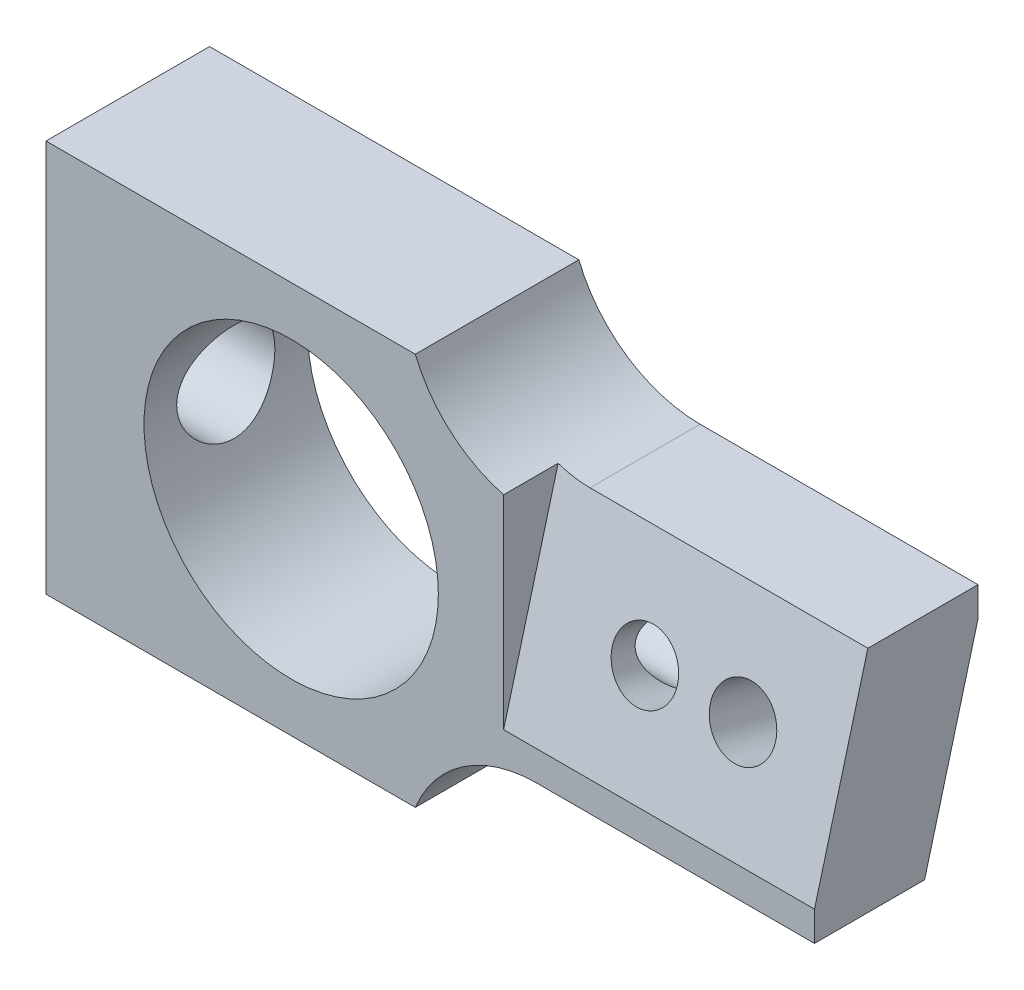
ISO-10303-21;
HEADER;
FILE_DESCRIPTION(('STEP AP214'),'2;1');
FILE_NAME('part.step','',(''),(''),'','','');
FILE_SCHEMA(('AUTOMOTIVE_DESIGN { 1 0 10303 214 1 1 1 1 }'));
ENDSEC;
DATA;
#1=APPLICATION_CONTEXT('core data for automotive mechanical design processes');
#2=APPLICATION_PROTOCOL_DEFINITION('international standard','automotive_design',2000,#1);
#3=PRODUCT_CONTEXT('',#1,'mechanical');
#4=PRODUCT('Part','Part','',(#3));
#5=PRODUCT_RELATED_PRODUCT_CATEGORY('part','',(#4));
#6=PRODUCT_DEFINITION_FORMATION('','',#4);
#7=PRODUCT_DEFINITION_CONTEXT('part definition',#1,'design');
#8=PRODUCT_DEFINITION('design','',#6,#7);
#9=PRODUCT_DEFINITION_SHAPE('','',#8);
#10=(LENGTH_UNIT() NAMED_UNIT(*) SI_UNIT(.MILLI.,.METRE.));
#11=(NAMED_UNIT(*) PLANE_ANGLE_UNIT() SI_UNIT($,.RADIAN.));
#12=(NAMED_UNIT(*) SI_UNIT($,.STERADIAN.) SOLID_ANGLE_UNIT());
#13=UNCERTAINTY_MEASURE_WITH_UNIT(LENGTH_MEASURE(1.E-05),#10,'distance_accuracy_value','');
#14=(GEOMETRIC_REPRESENTATION_CONTEXT(3) GLOBAL_UNCERTAINTY_ASSIGNED_CONTEXT((#13)) GLOBAL_UNIT_ASSIGNED_CONTEXT((#10,
#11,#12)) REPRESENTATION_CONTEXT('',''));
#15=CARTESIAN_POINT('',(0.,0.,0.));
#16=DIRECTION('',(0.,0.,1.));
#17=DIRECTION('',(1.,0.,0.));
#18=AXIS2_PLACEMENT_3D('',#15,#16,#17);
#19=CARTESIAN_POINT('',(50.8,-11.1125,7.9375));
#20=DIRECTION('',(-1.,0.,0.));
#21=DIRECTION('',(0.,0.,1.));
#22=AXIS2_PLACEMENT_3D('',#19,#20,#21);
#23=PLANE('',#22);
#24=DIRECTION('',(0.,0.965925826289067,-0.258819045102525));
#25=VECTOR('',#24,1.);
#26=CARTESIAN_POINT('',(50.8,-10.9193458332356,8.65836116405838));
#27=LINE('',#26,#25);
#28=CARTESIAN_POINT('',(50.8,-8.2290553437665,7.9375));
#29=VERTEX_POINT('',#28);
#30=CARTESIAN_POINT('',(50.8,11.1125,2.75494586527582));
#31=VERTEX_POINT('',#30);
#32=EDGE_CURVE('E156',#29,#31,#27,.T.);
#33=ORIENTED_EDGE('',*,*,#32,.F.);
#34=DIRECTION('',(0.,1.,0.));
#35=VECTOR('',#34,1.);
#36=CARTESIAN_POINT('',(50.8,-11.1125,7.9375));
#37=LINE('',#36,#35);
#38=CARTESIAN_POINT('',(50.8,-11.1125,7.9375));
#39=VERTEX_POINT('',#38);
#40=EDGE_CURVE('E195',#39,#29,#37,.T.);
#41=ORIENTED_EDGE('',*,*,#40,.F.);
#42=DIRECTION('',(0.,0.,-1.));
#43=VECTOR('',#42,1.);
#44=CARTESIAN_POINT('',(50.8,-11.1125,7.9375));
#45=LINE('',#44,#43);
#46=CARTESIAN_POINT('',(50.8,-11.1125,-2.75494586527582));
#47=VERTEX_POINT('',#46);
#48=EDGE_CURVE('E228',#39,#47,#45,.T.);
#49=ORIENTED_EDGE('',*,*,#48,.T.);
#50=DIRECTION('',(0.,-0.965925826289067,0.258819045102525));
#51=VECTOR('',#50,1.);
#52=CARTESIAN_POINT('',(50.8,-13.785611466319,-2.03868780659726));
#53=LINE('',#52,#51);
#54=CARTESIAN_POINT('',(50.8,8.2290553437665,-7.9375));
#55=VERTEX_POINT('',#54);
#56=EDGE_CURVE('E240',#55,#47,#53,.T.);
#57=ORIENTED_EDGE('',*,*,#56,.F.);
#58=DIRECTION('',(0.,1.,0.));
#59=VECTOR('',#58,1.);
#60=CARTESIAN_POINT('',(50.8,-11.1125,-7.9375));
#61=LINE('',#60,#59);
#62=CARTESIAN_POINT('',(50.8,11.1125,-7.9375));
#63=VERTEX_POINT('',#62);
#64=EDGE_CURVE('E210',#55,#63,#61,.T.);
#65=ORIENTED_EDGE('',*,*,#64,.T.);
#66=DIRECTION('',(0.,0.,-1.));
#67=VECTOR('',#66,1.);
#68=CARTESIAN_POINT('',(50.8,11.1125,7.9375));
#69=LINE('',#68,#67);
#70=EDGE_CURVE('E226',#31,#63,#69,.T.);
#71=ORIENTED_EDGE('',*,*,#70,.F.);
#72=EDGE_LOOP('',(#33,#41,#49,#57,#65,#71));
#73=FACE_BOUND('',#72,.T.);
#74=ADVANCED_FACE('F47',(#73),#23,.F.);
#75=CARTESIAN_POINT('',(23.8252,-23.8125,7.9375));
#76=DIRECTION('',(0.,0.,1.));
#77=DIRECTION('',(1.,0.,0.));
#78=AXIS2_PLACEMENT_3D('',#75,#76,#77);
#79=PLANE('',#78);
#80=CARTESIAN_POINT('',(0.,0.,7.9375));
#81=DIRECTION('',(0.,0.,1.));
#82=DIRECTION('',(1.,0.,0.));
#83=AXIS2_PLACEMENT_3D('',#80,#81,#82);
#84=CIRCLE('',#83,14.2875);
#85=CARTESIAN_POINT('',(14.2875,0.,7.9375));
#86=VERTEX_POINT('',#85);
#87=EDGE_CURVE('E179',#86,#86,#84,.T.);
#88=ORIENTED_EDGE('',*,*,#87,.F.);
#89=EDGE_LOOP('',(#88));
#90=FACE_BOUND('',#89,.T.);
#91=ORIENTED_EDGE('',*,*,#40,.T.);
#92=DIRECTION('',(-1.,0.,0.));
#93=VECTOR('',#92,1.);
#94=CARTESIAN_POINT('',(23.8252,-8.2290553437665,7.9375));
#95=LINE('',#94,#93);
#96=CARTESIAN_POINT('',(20.6248,-8.2290553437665,7.9375));
#97=VERTEX_POINT('',#96);
#98=EDGE_CURVE('E158',#29,#97,#95,.T.);
#99=ORIENTED_EDGE('',*,*,#98,.T.);
#100=DIRECTION('',(0.,-1.,0.));
#101=VECTOR('',#100,1.);
#102=CARTESIAN_POINT('',(20.6248,-23.8125,7.9375));
#103=LINE('',#102,#101);
#104=CARTESIAN_POINT('',(20.6248,11.5223641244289,7.9375));
#105=VERTEX_POINT('',#104);
#106=EDGE_CURVE('E149',#105,#97,#103,.T.);
#107=ORIENTED_EDGE('',*,*,#106,.F.);
#108=CARTESIAN_POINT('',(23.8252,23.8125,7.9375));
#109=DIRECTION('',(0.,0.,-1.));
#110=DIRECTION('',(1.,0.,0.));
#111=AXIS2_PLACEMENT_3D('',#108,#109,#110);
#112=CIRCLE('',#111,12.7);
#113=CARTESIAN_POINT('',(12.0519849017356,19.05,7.9375));
#114=VERTEX_POINT('',#113);
#115=EDGE_CURVE('E198',#105,#114,#112,.T.);
#116=ORIENTED_EDGE('',*,*,#115,.T.);
#117=DIRECTION('',(-1.,0.,0.));
#118=VECTOR('',#117,1.);
#119=CARTESIAN_POINT('',(12.0519849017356,19.05,7.9375));
#120=LINE('',#119,#118);
#121=CARTESIAN_POINT('',(-23.7998,19.05,7.9375));
#122=VERTEX_POINT('',#121);
#123=EDGE_CURVE('E200',#114,#122,#120,.T.);
#124=ORIENTED_EDGE('',*,*,#123,.T.);
#125=DIRECTION('',(0.,-1.,0.));
#126=VECTOR('',#125,1.);
#127=CARTESIAN_POINT('',(-23.7998,19.05,7.9375));
#128=LINE('',#127,#126);
#129=CARTESIAN_POINT('',(-23.7998,-19.05,7.9375));
#130=VERTEX_POINT('',#129);
#131=EDGE_CURVE('E185',#122,#130,#128,.T.);
#132=ORIENTED_EDGE('',*,*,#131,.T.);
#133=DIRECTION('',(1.,0.,0.));
#134=VECTOR('',#133,1.);
#135=CARTESIAN_POINT('',(-23.7998,-19.05,7.9375));
#136=LINE('',#135,#134);
#137=CARTESIAN_POINT('',(12.0519849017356,-19.05,7.9375));
#138=VERTEX_POINT('',#137);
#139=EDGE_CURVE('E188',#130,#138,#136,.T.);
#140=ORIENTED_EDGE('',*,*,#139,.T.);
#141=CARTESIAN_POINT('',(23.8252,-23.8125,7.9375));
#142=DIRECTION('',(0.,0.,-1.));
#143=DIRECTION('',(1.,0.,0.));
#144=AXIS2_PLACEMENT_3D('',#141,#142,#143);
#145=CIRCLE('',#144,12.7);
#146=CARTESIAN_POINT('',(23.8252,-11.1125,7.9375));
#147=VERTEX_POINT('',#146);
#148=EDGE_CURVE('E191',#138,#147,#145,.T.);
#149=ORIENTED_EDGE('',*,*,#148,.T.);
#150=DIRECTION('',(1.,0.,0.));
#151=VECTOR('',#150,1.);
#152=CARTESIAN_POINT('',(50.8,-11.1125,7.9375));
#153=LINE('',#152,#151);
#154=EDGE_CURVE('E193',#147,#39,#153,.T.);
#155=ORIENTED_EDGE('',*,*,#154,.T.);
#156=EDGE_LOOP('',(#91,#99,#107,#116,#124,#132,#140,#149,#155));
#157=FACE_BOUND('',#156,.T.);
#158=ADVANCED_FACE('F287',(#90,#157),#79,.T.);
#159=CARTESIAN_POINT('',(50.8,11.1125,7.9375));
#160=DIRECTION('',(0.,-1.,0.));
#161=DIRECTION('',(1.,0.,0.));
#162=AXIS2_PLACEMENT_3D('',#159,#160,#161);
#163=PLANE('',#162);
#164=DIRECTION('',(-1.,0.,0.));
#165=VECTOR('',#164,1.);
#166=CARTESIAN_POINT('',(50.8,11.1125,2.75494586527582));
#167=LINE('',#166,#165);
#168=CARTESIAN_POINT('',(23.8252,11.1125,2.75494586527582));
#169=VERTEX_POINT('',#168);
#170=EDGE_CURVE('E154',#31,#169,#167,.T.);
#171=ORIENTED_EDGE('',*,*,#170,.F.);
#172=ORIENTED_EDGE('',*,*,#70,.T.);
#173=DIRECTION('',(-1.,0.,0.));
#174=VECTOR('',#173,1.);
#175=CARTESIAN_POINT('',(50.8,11.1125,-7.9375));
#176=LINE('',#175,#174);
#177=CARTESIAN_POINT('',(23.8252,11.1125,-7.9375));
#178=VERTEX_POINT('',#177);
#179=EDGE_CURVE('E213',#63,#178,#176,.T.);
#180=ORIENTED_EDGE('',*,*,#179,.T.);
#181=DIRECTION('',(0.,0.,-1.));
#182=VECTOR('',#181,1.);
#183=CARTESIAN_POINT('',(23.8252,11.1125,7.9375));
#184=LINE('',#183,#182);
#185=EDGE_CURVE('E224',#169,#178,#184,.T.);
#186=ORIENTED_EDGE('',*,*,#185,.F.);
#187=EDGE_LOOP('',(#171,#172,#180,#186));
#188=FACE_BOUND('',#187,.T.);
#189=ADVANCED_FACE('F293',(#188),#163,.F.);
#190=CARTESIAN_POINT('',(23.8252,23.8125,7.9375));
#191=DIRECTION('',(0.,0.,-1.));
#192=DIRECTION('',(-1.,0.,0.));
#193=AXIS2_PLACEMENT_3D('',#190,#191,#192);
#194=CYLINDRICAL_SURFACE('',#193,12.7);
#195=CARTESIAN_POINT('',(23.8252,23.8125,-0.64800887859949));
#196=DIRECTION('',(0.,0.258819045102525,0.965925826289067));
#197=DIRECTION('',(0.,0.965925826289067,-0.258819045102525));
#198=AXIS2_PLACEMENT_3D('',#195,#196,#197);
#199=ELLIPSE('',#198,13.1480074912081,12.7);
#200=CARTESIAN_POINT('',(20.6248,11.5223641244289,2.64512310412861));
#201=VERTEX_POINT('',#200);
#202=EDGE_CURVE('E13',#169,#201,#199,.F.);
#203=ORIENTED_EDGE('',*,*,#202,.F.);
#204=ORIENTED_EDGE('',*,*,#185,.T.);
#205=CARTESIAN_POINT('',(23.8252,23.8125,-7.9375));
#206=DIRECTION('',(0.,0.,-1.));
#207=DIRECTION('',(1.,0.,0.));
#208=AXIS2_PLACEMENT_3D('',#205,#206,#207);
#209=CIRCLE('',#208,12.7);
#210=CARTESIAN_POINT('',(12.0519849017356,19.05,-7.9375));
#211=VERTEX_POINT('',#210);
#212=EDGE_CURVE('E216',#178,#211,#209,.T.);
#213=ORIENTED_EDGE('',*,*,#212,.T.);
#214=DIRECTION('',(0.,0.,-1.));
#215=VECTOR('',#214,1.);
#216=CARTESIAN_POINT('',(12.0519849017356,19.05,7.9375));
#217=LINE('',#216,#215);
#218=EDGE_CURVE('E221',#114,#211,#217,.T.);
#219=ORIENTED_EDGE('',*,*,#218,.F.);
#220=ORIENTED_EDGE('',*,*,#115,.F.);
#221=DIRECTION('',(0.,0.,-1.));
#222=VECTOR('',#221,1.);
#223=CARTESIAN_POINT('',(20.6248,11.5223641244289,7.9375));
#224=LINE('',#223,#222);
#225=EDGE_CURVE('E56',#105,#201,#224,.T.);
#226=ORIENTED_EDGE('',*,*,#225,.T.);
#227=EDGE_LOOP('',(#203,#204,#213,#219,#220,#226));
#228=FACE_BOUND('',#227,.T.);
#229=ADVANCED_FACE('F348',(#228),#194,.F.);
#230=CARTESIAN_POINT('',(23.8252,-23.8125,-7.9375));
#231=DIRECTION('',(0.,0.,1.));
#232=DIRECTION('',(1.,0.,0.));
#233=AXIS2_PLACEMENT_3D('',#230,#231,#232);
#234=PLANE('',#233);
#235=CARTESIAN_POINT('',(0.,0.,-7.9375));
#236=DIRECTION('',(0.,0.,1.));
#237=DIRECTION('',(1.,0.,0.));
#238=AXIS2_PLACEMENT_3D('',#235,#236,#237);
#239=CIRCLE('',#238,14.2875);
#240=CARTESIAN_POINT('',(14.2875,0.,-7.9375));
#241=VERTEX_POINT('',#240);
#242=EDGE_CURVE('E177',#241,#241,#239,.T.);
#243=ORIENTED_EDGE('',*,*,#242,.T.);
#244=EDGE_LOOP('',(#243));
#245=FACE_BOUND('',#244,.T.);
#246=DIRECTION('',(1.,0.,0.));
#247=VECTOR('',#246,1.);
#248=CARTESIAN_POINT('',(23.8252,8.22905534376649,-7.9375));
#249=LINE('',#248,#247);
#250=CARTESIAN_POINT('',(20.6248,8.22905534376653,-7.9375));
#251=VERTEX_POINT('',#250);
#252=EDGE_CURVE('E168',#251,#55,#249,.T.);
#253=ORIENTED_EDGE('',*,*,#252,.F.);
#254=DIRECTION('',(0.,-1.,0.));
#255=VECTOR('',#254,1.);
#256=CARTESIAN_POINT('',(20.6248,-23.8125,-7.9375));
#257=LINE('',#256,#255);
#258=CARTESIAN_POINT('',(20.6248,-11.5223641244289,-7.9375));
#259=VERTEX_POINT('',#258);
#260=EDGE_CURVE('E170',#251,#259,#257,.T.);
#261=ORIENTED_EDGE('',*,*,#260,.T.);
#262=CARTESIAN_POINT('',(23.8252,-23.8125,-7.9375));
#263=DIRECTION('',(0.,0.,-1.));
#264=DIRECTION('',(1.,0.,0.));
#265=AXIS2_PLACEMENT_3D('',#262,#263,#264);
#266=CIRCLE('',#265,12.7);
#267=CARTESIAN_POINT('',(12.0519849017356,-19.05,-7.9375));
#268=VERTEX_POINT('',#267);
#269=EDGE_CURVE('E207',#268,#259,#266,.T.);
#270=ORIENTED_EDGE('',*,*,#269,.F.);
#271=DIRECTION('',(1.,0.,0.));
#272=VECTOR('',#271,1.);
#273=CARTESIAN_POINT('',(-23.7998,-19.05,-7.9375));
#274=LINE('',#273,#272);
#275=CARTESIAN_POINT('',(-23.7998,-19.05,-7.9375));
#276=VERTEX_POINT('',#275);
#277=EDGE_CURVE('E205',#276,#268,#274,.T.);
#278=ORIENTED_EDGE('',*,*,#277,.F.);
#279=DIRECTION('',(0.,-1.,0.));
#280=VECTOR('',#279,1.);
#281=CARTESIAN_POINT('',(-23.7998,19.05,-7.9375));
#282=LINE('',#281,#280);
#283=CARTESIAN_POINT('',(-23.7998,19.05,-7.9375));
#284=VERTEX_POINT('',#283);
#285=EDGE_CURVE('E182',#284,#276,#282,.T.);
#286=ORIENTED_EDGE('',*,*,#285,.F.);
#287=DIRECTION('',(-1.,0.,0.));
#288=VECTOR('',#287,1.);
#289=CARTESIAN_POINT('',(12.0519849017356,19.05,-7.9375));
#290=LINE('',#289,#288);
#291=EDGE_CURVE('E189',#211,#284,#290,.T.);
#292=ORIENTED_EDGE('',*,*,#291,.F.);
#293=ORIENTED_EDGE('',*,*,#212,.F.);
#294=ORIENTED_EDGE('',*,*,#179,.F.);
#295=ORIENTED_EDGE('',*,*,#64,.F.);
#296=EDGE_LOOP('',(#253,#261,#270,#278,#286,#292,#293,#294,#295));
#297=FACE_BOUND('',#296,.T.);
#298=ADVANCED_FACE('F305',(#245,#297),#234,.F.);
#299=CARTESIAN_POINT('',(23.8252,-23.8125,7.9375));
#300=DIRECTION('',(0.,0.,-1.));
#301=DIRECTION('',(-1.,0.,0.));
#302=AXIS2_PLACEMENT_3D('',#299,#300,#301);
#303=CYLINDRICAL_SURFACE('',#302,12.7);
#304=CARTESIAN_POINT('',(23.8252,-23.8125,0.648008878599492));
#305=DIRECTION('',(0.,-0.258819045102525,-0.965925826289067));
#306=DIRECTION('',(0.,0.965925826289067,-0.258819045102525));
#307=AXIS2_PLACEMENT_3D('',#304,#305,#306);
#308=ELLIPSE('',#307,13.1480074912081,12.7);
#309=CARTESIAN_POINT('',(23.8252,-11.1125,-2.75494586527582));
#310=VERTEX_POINT('',#309);
#311=CARTESIAN_POINT('',(20.6248,-11.5223641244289,-2.64512310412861));
#312=VERTEX_POINT('',#311);
#313=EDGE_CURVE('E166',#310,#312,#308,.F.);
#314=ORIENTED_EDGE('',*,*,#313,.F.);
#315=DIRECTION('',(0.,0.,-1.));
#316=VECTOR('',#315,1.);
#317=CARTESIAN_POINT('',(23.8252,-11.1125,7.9375));
#318=LINE('',#317,#316);
#319=EDGE_CURVE('E231',#147,#310,#318,.T.);
#320=ORIENTED_EDGE('',*,*,#319,.F.);
#321=ORIENTED_EDGE('',*,*,#148,.F.);
#322=DIRECTION('',(0.,0.,-1.));
#323=VECTOR('',#322,1.);
#324=CARTESIAN_POINT('',(12.0519849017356,-19.05,7.9375));
#325=LINE('',#324,#323);
#326=EDGE_CURVE('E234',#138,#268,#325,.T.);
#327=ORIENTED_EDGE('',*,*,#326,.T.);
#328=ORIENTED_EDGE('',*,*,#269,.T.);
#329=DIRECTION('',(0.,0.,-1.));
#330=VECTOR('',#329,1.);
#331=CARTESIAN_POINT('',(20.6248,-11.5223641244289,7.9375));
#332=LINE('',#331,#330);
#333=EDGE_CURVE('E329',#259,#312,#332,.F.);
#334=ORIENTED_EDGE('',*,*,#333,.T.);
#335=EDGE_LOOP('',(#314,#320,#321,#327,#328,#334));
#336=FACE_BOUND('',#335,.T.);
#337=ADVANCED_FACE('F302',(#336),#303,.F.);
#338=CARTESIAN_POINT('',(50.8,-11.1125,7.9375));
#339=DIRECTION('',(0.,1.,0.));
#340=DIRECTION('',(-1.,0.,0.));
#341=AXIS2_PLACEMENT_3D('',#338,#339,#340);
#342=PLANE('',#341);
#343=DIRECTION('',(-1.,0.,0.));
#344=VECTOR('',#343,1.);
#345=CARTESIAN_POINT('',(50.8,-11.1125,-2.75494586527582));
#346=LINE('',#345,#344);
#347=EDGE_CURVE('E164',#47,#310,#346,.T.);
#348=ORIENTED_EDGE('',*,*,#347,.F.);
#349=ORIENTED_EDGE('',*,*,#48,.F.);
#350=ORIENTED_EDGE('',*,*,#154,.F.);
#351=ORIENTED_EDGE('',*,*,#319,.T.);
#352=EDGE_LOOP('',(#348,#349,#350,#351));
#353=FACE_BOUND('',#352,.T.);
#354=ADVANCED_FACE('F299',(#353),#342,.F.);
#355=CARTESIAN_POINT('',(0.,0.,7.9375));
#356=DIRECTION('',(0.,0.,-1.));
#357=DIRECTION('',(-1.,0.,0.));
#358=AXIS2_PLACEMENT_3D('',#355,#356,#357);
#359=CYLINDRICAL_SURFACE('',#358,14.2875);
#360=ORIENTED_EDGE('',*,*,#242,.F.);
#361=EDGE_LOOP('',(#360));
#362=FACE_BOUND('',#361,.T.);
#363=ORIENTED_EDGE('',*,*,#87,.T.);
#364=EDGE_LOOP('',(#363));
#365=FACE_BOUND('',#364,.T.);
#366=CARTESIAN_POINT('',(-14.2875,0.,4.7625));
#367=CARTESIAN_POINT('',(-14.2875007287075,-0.259858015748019,4.76250120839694));
#368=CARTESIAN_POINT('',(-14.2803452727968,-0.519708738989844,4.74116273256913));
#369=CARTESIAN_POINT('',(-14.2525056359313,-1.03175638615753,4.656633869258));
#370=CARTESIAN_POINT('',(-14.2318200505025,-1.28395251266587,4.59343913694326));
#371=CARTESIAN_POINT('',(-14.1791677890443,-1.77323491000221,4.42760460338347));
#372=CARTESIAN_POINT('',(-14.1472199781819,-2.01034567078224,4.32503074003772));
#373=CARTESIAN_POINT('',(-14.0753042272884,-2.46399813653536,4.08364766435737));
#374=CARTESIAN_POINT('',(-14.0353347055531,-2.68053577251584,3.94483130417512));
#375=CARTESIAN_POINT('',(-13.950033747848,-3.09439472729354,3.62985460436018));
#376=CARTESIAN_POINT('',(-13.9045738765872,-3.29090512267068,3.45266374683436));
#377=CARTESIAN_POINT('',(-13.8141224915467,-3.65204069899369,3.06815892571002));
#378=CARTESIAN_POINT('',(-13.7691310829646,-3.81665885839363,2.8608383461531));
#379=CARTESIAN_POINT('',(-13.6832974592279,-4.1139662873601,2.41465838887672));
#380=CARTESIAN_POINT('',(-13.6426117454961,-4.24560138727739,2.17506356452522));
#381=CARTESIAN_POINT('',(-13.5719489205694,-4.46636238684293,1.67556135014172));
#382=CARTESIAN_POINT('',(-13.5419685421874,-4.5555012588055,1.41566018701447));
#383=CARTESIAN_POINT('',(-13.4974633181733,-4.68569736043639,0.892143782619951));
#384=CARTESIAN_POINT('',(-13.4824515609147,-4.72827404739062,0.628949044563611));
#385=CARTESIAN_POINT('',(-13.4681431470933,-4.76888709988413,0.0987563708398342));
#386=CARTESIAN_POINT('',(-13.4688416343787,-4.76693722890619,-0.16824036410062));
#387=CARTESIAN_POINT('',(-13.485448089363,-4.71973229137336,-0.685498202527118));
#388=CARTESIAN_POINT('',(-13.5006595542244,-4.67646026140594,-0.935966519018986));
#389=CARTESIAN_POINT('',(-13.5434383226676,-4.55107435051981,-1.42586116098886));
#390=CARTESIAN_POINT('',(-13.5710071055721,-4.46895581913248,-1.66528616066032));
#391=CARTESIAN_POINT('',(-13.6358905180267,-4.2669097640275,-2.13080321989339));
#392=CARTESIAN_POINT('',(-13.6733549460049,-4.14639465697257,-2.35661847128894));
#393=CARTESIAN_POINT('',(-13.7537456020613,-3.87138436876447,-2.78544770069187));
#394=CARTESIAN_POINT('',(-13.7966734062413,-3.71687937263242,-2.98845506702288));
#395=CARTESIAN_POINT('',(-13.8858940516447,-3.36875119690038,-3.37704873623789));
#396=CARTESIAN_POINT('',(-13.9322455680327,-3.17350687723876,-3.5611722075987));
#397=CARTESIAN_POINT('',(-14.0211304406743,-2.7543422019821,-3.89444515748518));
#398=CARTESIAN_POINT('',(-14.0636634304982,-2.53041909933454,-4.04359128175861));
#399=CARTESIAN_POINT('',(-14.1406772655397,-2.05715050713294,-4.30385362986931));
#400=CARTESIAN_POINT('',(-14.1750740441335,-1.80757485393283,-4.41457790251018));
#401=CARTESIAN_POINT('',(-14.2313295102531,-1.29191900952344,-4.59201761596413));
#402=CARTESIAN_POINT('',(-14.2531925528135,-1.02584458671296,-4.65874834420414));
#403=CARTESIAN_POINT('',(-14.2811957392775,-0.497127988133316,-4.74371510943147));
#404=CARTESIAN_POINT('',(-14.2879763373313,-0.234836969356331,-4.76392784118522));
#405=CARTESIAN_POINT('',(-14.2869714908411,0.289441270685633,-4.7609156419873));
#406=CARTESIAN_POINT('',(-14.2791885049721,0.551428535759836,-4.73769804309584));
#407=CARTESIAN_POINT('',(-14.2503536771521,1.05975086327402,-4.6500482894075));
#408=CARTESIAN_POINT('',(-14.2296927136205,1.30631949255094,-4.58682944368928));
#409=CARTESIAN_POINT('',(-14.1775742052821,1.78525150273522,-4.42248872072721));
#410=CARTESIAN_POINT('',(-14.1461152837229,2.01761306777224,-4.32136201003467));
#411=CARTESIAN_POINT('',(-14.0745653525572,2.46834801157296,-4.08112706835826));
#412=CARTESIAN_POINT('',(-14.0342690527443,2.68619268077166,-3.9410897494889));
#413=CARTESIAN_POINT('',(-13.949612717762,3.09593375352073,-3.62810036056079));
#414=CARTESIAN_POINT('',(-13.905251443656,3.28782220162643,-3.45513823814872));
#415=CARTESIAN_POINT('',(-13.8149098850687,3.6492775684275,-3.07191369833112));
#416=CARTESIAN_POINT('',(-13.7689476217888,3.81743411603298,-2.86031355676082));
#417=CARTESIAN_POINT('',(-13.6826612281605,4.11602645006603,-2.41091290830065));
#418=CARTESIAN_POINT('',(-13.6423371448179,4.24646192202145,-2.17311218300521));
#419=CARTESIAN_POINT('',(-13.5722864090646,4.46530538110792,-1.67795726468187));
#420=CARTESIAN_POINT('',(-13.5425383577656,4.55379835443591,-1.42064384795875));
#421=CARTESIAN_POINT('',(-13.4974408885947,4.68579835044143,-0.893546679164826));
#422=CARTESIAN_POINT('',(-13.4820849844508,4.72932563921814,-0.623768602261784));
#423=CARTESIAN_POINT('',(-13.4682480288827,4.76857829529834,-0.0943113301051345));
#424=CARTESIAN_POINT('',(-13.4689405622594,4.76664460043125,0.165174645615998));
#425=CARTESIAN_POINT('',(-13.4850792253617,4.7207914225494,0.679918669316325));
#426=CARTESIAN_POINT('',(-13.5005244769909,4.67687443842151,0.935176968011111));
#427=CARTESIAN_POINT('',(-13.5438129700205,4.54995826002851,1.42939609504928));
#428=CARTESIAN_POINT('',(-13.5714151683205,4.46771718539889,1.66857437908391));
#429=CARTESIAN_POINT('',(-13.6358184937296,4.26710172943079,2.12992052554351));
#430=CARTESIAN_POINT('',(-13.6726216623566,4.1487193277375,2.35208459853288));
#431=CARTESIAN_POINT('',(-13.7532822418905,3.87315404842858,2.78360347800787));
#432=CARTESIAN_POINT('',(-13.7973773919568,3.71450350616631,2.99197634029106));
#433=CARTESIAN_POINT('',(-13.8866573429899,3.36538673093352,3.37989773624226));
#434=CARTESIAN_POINT('',(-13.9318424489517,3.17491150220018,3.55943809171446));
#435=CARTESIAN_POINT('',(-14.020325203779,2.75863791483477,3.89165026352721));
#436=CARTESIAN_POINT('',(-14.0634806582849,2.53175220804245,4.04300220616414));
#437=CARTESIAN_POINT('',(-14.1411003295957,2.05433941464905,4.30525441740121));
#438=CARTESIAN_POINT('',(-14.1755667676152,1.80381839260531,4.41616502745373));
#439=CARTESIAN_POINT('',(-14.2306126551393,1.29775099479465,4.5897242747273));
#440=CARTESIAN_POINT('',(-14.2517437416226,1.0429291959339,4.65430774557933));
#441=CARTESIAN_POINT('',(-14.2801851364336,0.525400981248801,4.74068908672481));
#442=CARTESIAN_POINT('',(-14.287499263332,0.262696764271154,4.76249877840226));
#443=CARTESIAN_POINT('',(-14.2875,0.,4.7625));
#444=B_SPLINE_CURVE_WITH_KNOTS('',3,(#366,#367,#368,#369,#370,#371,#372,#373,#374,#375,#376,
#377,#378,#379,#380,#381,#382,#383,#384,#385,#386,#387,#388,#389,#390,#391,#392,#393,#394,#395,
#396,#397,#398,#399,#400,#401,#402,#403,#404,#405,#406,#407,#408,#409,#410,#411,#412,#413,#414,
#415,#416,#417,#418,#419,#420,#421,#422,#423,#424,#425,#426,#427,#428,#429,#430,#431,#432,#433,
#434,#435,#436,#437,#438,#439,#440,#441,#442,#443),.UNSPECIFIED.,.T.,.F.,(4,2,2,2,2,2,2,2,2,2,2,
2,2,2,2,2,2,2,2,2,2,2,2,2,2,2,2,2,2,2,2,2,2,2,2,2,2,2,4),(0.,0.778607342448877,1.55729551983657,
2.33468547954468,3.11222887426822,3.91404558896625,4.71603863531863,5.54109182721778,
6.36589300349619,7.16289171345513,7.95964406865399,8.71998636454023,9.48041970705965,
10.2530991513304,11.0260020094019,11.8392561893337,12.6525883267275,13.4739890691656,
14.2951042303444,15.0806268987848,15.8660169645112,16.6286572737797,17.3913948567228,
18.1741952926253,18.9572351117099,19.7758537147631,20.594479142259,21.4114386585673,
22.228029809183,23.0026685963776,23.7772612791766,24.5371423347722,25.2971921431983,
26.0904069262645,26.8838463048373,27.708208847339,28.5323604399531,29.3196910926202,
30.1068041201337),.UNSPECIFIED.);
#445=CARTESIAN_POINT('',(-14.2875,0.,4.7625));
#446=VERTEX_POINT('',#445);
#447=EDGE_CURVE('E178',#446,#446,#444,.T.);
#448=ORIENTED_EDGE('',*,*,#447,.F.);
#449=EDGE_LOOP('',(#448));
#450=FACE_BOUND('',#449,.T.);
#451=CARTESIAN_POINT('',(14.2875,0.,3.175));
#452=CARTESIAN_POINT('',(14.2874967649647,-0.176022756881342,3.17499408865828));
#453=CARTESIAN_POINT('',(14.2842140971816,-0.352116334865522,3.16031247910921));
#454=CARTESIAN_POINT('',(14.271436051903,-0.699296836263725,3.10203775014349));
#455=CARTESIAN_POINT('',(14.2619363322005,-0.870380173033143,3.05842442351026));
#456=CARTESIAN_POINT('',(14.2377812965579,-1.20247295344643,2.9437235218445));
#457=CARTESIAN_POINT('',(14.22313145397,-1.3634928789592,2.87266510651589));
#458=CARTESIAN_POINT('',(14.1902550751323,-1.6713202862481,2.70518475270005));
#459=CARTESIAN_POINT('',(14.1720286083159,-1.81812804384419,2.60876330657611));
#460=CARTESIAN_POINT('',(14.133656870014,-2.09579577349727,2.39160738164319));
#461=CARTESIAN_POINT('',(14.1134871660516,-2.22638717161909,2.27053377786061));
#462=CARTESIAN_POINT('',(14.0736732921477,-2.46558579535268,2.00823820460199));
#463=CARTESIAN_POINT('',(14.0540291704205,-2.5741910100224,1.86701439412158));
#464=CARTESIAN_POINT('',(14.0172492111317,-2.76752753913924,1.56643094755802));
#465=CARTESIAN_POINT('',(14.0001446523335,-2.85197140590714,1.40688225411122));
#466=CARTESIAN_POINT('',(13.9707317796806,-2.99274387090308,1.07541574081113));
#467=CARTESIAN_POINT('',(13.9584228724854,-3.04907594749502,0.903499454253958));
#468=CARTESIAN_POINT('',(13.9402440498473,-3.13113512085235,0.555095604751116));
#469=CARTESIAN_POINT('',(13.9342740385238,-3.15733853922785,0.378725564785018));
#470=CARTESIAN_POINT('',(13.9291484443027,-3.17987792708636,0.0239994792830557));
#471=CARTESIAN_POINT('',(13.9299919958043,-3.17621769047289,-0.154356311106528));
#472=CARTESIAN_POINT('',(13.9383076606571,-3.13951663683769,-0.504438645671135));
#473=CARTESIAN_POINT('',(13.9456545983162,-3.10703062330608,-0.676226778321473));
#474=CARTESIAN_POINT('',(13.965951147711,-3.01447978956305,-1.01185209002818));
#475=CARTESIAN_POINT('',(13.9789010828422,-2.95441337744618,-1.1756888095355));
#476=CARTESIAN_POINT('',(14.0090669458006,-2.80790130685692,-1.49231260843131));
#477=CARTESIAN_POINT('',(14.0263169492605,-2.72124359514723,-1.64499818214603));
#478=CARTESIAN_POINT('',(14.0631185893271,-2.5241578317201,-1.93386530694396));
#479=CARTESIAN_POINT('',(14.0826705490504,-2.4137264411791,-2.07004453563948));
#480=CARTESIAN_POINT('',(14.1224091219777,-2.16929785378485,-2.3252260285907));
#481=CARTESIAN_POINT('',(14.1426001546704,-2.03482925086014,-2.44377652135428));
#482=CARTESIAN_POINT('',(14.1809444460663,-1.74768925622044,-2.65671891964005));
#483=CARTESIAN_POINT('',(14.1990976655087,-1.59501751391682,-2.75111035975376));
#484=CARTESIAN_POINT('',(14.2313828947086,-1.27524381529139,-2.91317247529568));
#485=CARTESIAN_POINT('',(14.2455057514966,-1.10811011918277,-2.98078246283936));
#486=CARTESIAN_POINT('',(14.2680711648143,-0.76447004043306,-3.08683185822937));
#487=CARTESIAN_POINT('',(14.2765145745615,-0.587965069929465,-3.12527564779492));
#488=CARTESIAN_POINT('',(14.2866477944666,-0.234466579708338,-3.17124082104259));
#489=CARTESIAN_POINT('',(14.2884723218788,-0.0575570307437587,-3.17937911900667));
#490=CARTESIAN_POINT('',(14.2855403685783,0.29509390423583,-3.16617650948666));
#491=CARTESIAN_POINT('',(14.2807843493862,0.470835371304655,-3.14483766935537));
#492=CARTESIAN_POINT('',(14.2653108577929,0.814106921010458,-3.07379780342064));
#493=CARTESIAN_POINT('',(14.2546617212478,0.981707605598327,-3.02442172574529));
#494=CARTESIAN_POINT('',(14.2285945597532,1.30624707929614,-2.89907077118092));
#495=CARTESIAN_POINT('',(14.2131761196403,1.46318493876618,-2.82309357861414));
#496=CARTESIAN_POINT('',(14.1789491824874,1.76448472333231,-2.64542130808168));
#497=CARTESIAN_POINT('',(14.1600943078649,1.90862859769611,-2.54336559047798));
#498=CARTESIAN_POINT('',(14.1211781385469,2.17796580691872,-2.3169066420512));
#499=CARTESIAN_POINT('',(14.1011166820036,2.30315659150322,-2.19250040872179));
#500=CARTESIAN_POINT('',(14.0615809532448,2.53348407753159,-1.92203699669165));
#501=CARTESIAN_POINT('',(14.0421251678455,2.63819293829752,-1.77561225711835));
#502=CARTESIAN_POINT('',(14.0064394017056,2.82153696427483,-1.466894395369));
#503=CARTESIAN_POINT('',(13.9902092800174,2.90017326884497,-1.30460196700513));
#504=CARTESIAN_POINT('',(13.9629705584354,3.02860078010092,-0.969631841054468));
#505=CARTESIAN_POINT('',(13.9519323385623,3.07855598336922,-0.797019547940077));
#506=CARTESIAN_POINT('',(13.9362759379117,3.14867968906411,-0.445572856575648));
#507=CARTESIAN_POINT('',(13.9316566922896,3.16885313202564,-0.266739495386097));
#508=CARTESIAN_POINT('',(13.9294298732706,3.1786251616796,0.0877552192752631));
#509=CARTESIAN_POINT('',(13.9316666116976,3.16890262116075,0.263397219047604));
#510=CARTESIAN_POINT('',(13.9425468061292,3.12068014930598,0.610472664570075));
#511=CARTESIAN_POINT('',(13.9511901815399,3.08218057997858,0.78190616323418));
#512=CARTESIAN_POINT('',(13.9738326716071,2.97782964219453,1.11513797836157));
#513=CARTESIAN_POINT('',(13.9878118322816,2.91208010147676,1.2769696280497));
#514=CARTESIAN_POINT('',(14.0195580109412,2.75518197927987,1.58740473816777));
#515=CARTESIAN_POINT('',(14.0373254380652,2.66403065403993,1.73600676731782));
#516=CARTESIAN_POINT('',(14.0751090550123,2.45667782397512,2.01910411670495));
#517=CARTESIAN_POINT('',(14.0951643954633,2.33999381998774,2.15324087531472));
#518=CARTESIAN_POINT('',(14.1350043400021,2.08586182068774,2.40025249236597));
#519=CARTESIAN_POINT('',(14.1547888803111,1.94840902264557,2.5131224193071));
#520=CARTESIAN_POINT('',(14.1921747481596,1.65440672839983,2.71585687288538));
#521=CARTESIAN_POINT('',(14.2097430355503,1.49762469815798,2.80539062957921));
#522=CARTESIAN_POINT('',(14.2403839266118,1.17087694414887,2.95669224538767));
#523=CARTESIAN_POINT('',(14.2534602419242,1.00092224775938,3.01848304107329));
#524=CARTESIAN_POINT('',(14.2713521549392,0.692369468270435,3.1017231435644));
#525=CARTESIAN_POINT('',(14.2773696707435,0.555421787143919,3.12914883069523));
#526=CARTESIAN_POINT('',(14.2854447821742,0.278997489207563,3.16578917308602));
#527=CARTESIAN_POINT('',(14.2875025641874,0.139520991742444,3.17500468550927));
#528=CARTESIAN_POINT('',(14.2875,0.,3.175));
#529=B_SPLINE_CURVE_WITH_KNOTS('',3,(#451,#452,#453,#454,#455,#456,#457,#458,#459,#460,#461,
#462,#463,#464,#465,#466,#467,#468,#469,#470,#471,#472,#473,#474,#475,#476,#477,#478,#479,#480,
#481,#482,#483,#484,#485,#486,#487,#488,#489,#490,#491,#492,#493,#494,#495,#496,#497,#498,#499,
#500,#501,#502,#503,#504,#505,#506,#507,#508,#509,#510,#511,#512,#513,#514,#515,#516,#517,#518,
#519,#520,#521,#522,#523,#524,#525,#526,#527,#528),.UNSPECIFIED.,.T.,.F.,(4,2,2,2,2,2,2,2,2,2,2,
2,2,2,2,2,2,2,2,2,2,2,2,2,2,2,2,2,2,2,2,2,2,2,2,2,2,2,4),(0.,0.527557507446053,1.05548387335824,
1.58285086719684,2.1102076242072,2.645379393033,3.18060008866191,3.72194607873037,
4.26322506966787,4.79582361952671,5.32835450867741,5.85085298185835,6.3733816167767,
6.90019050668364,7.42707343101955,7.96572860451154,8.50439415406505,9.04427345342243,
9.58407162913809,10.1128193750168,10.6415300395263,11.1642345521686,11.6869845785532,
12.2173968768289,12.7478804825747,13.2884778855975,13.8290516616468,14.3665028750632,
14.9038649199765,15.4291154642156,15.9543594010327,16.4776580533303,17.0010132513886,
17.5352761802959,18.069662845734,18.6112560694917,19.1524007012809,19.5705785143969,
19.988736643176),.UNSPECIFIED.);
#530=CARTESIAN_POINT('',(14.2875,0.,3.175));
#531=VERTEX_POINT('',#530);
#532=EDGE_CURVE('E173',#531,#531,#529,.T.);
#533=ORIENTED_EDGE('',*,*,#532,.T.);
#534=EDGE_LOOP('',(#533));
#535=FACE_BOUND('',#534,.T.);
#536=ADVANCED_FACE('F251',(#362,#365,#450,#535),#359,.F.);
#537=CARTESIAN_POINT('',(-23.7998,19.05,7.9375));
#538=DIRECTION('',(1.,0.,0.));
#539=DIRECTION('',(0.,0.,-1.));
#540=AXIS2_PLACEMENT_3D('',#537,#538,#539);
#541=PLANE('',#540);
#542=CARTESIAN_POINT('',(-23.7998,0.,0.));
#543=DIRECTION('',(1.,0.,0.));
#544=DIRECTION('',(0.,0.,-1.));
#545=AXIS2_PLACEMENT_3D('',#542,#543,#544);
#546=CIRCLE('',#545,4.7625);
#547=CARTESIAN_POINT('',(-23.7998,0.,-4.7625));
#548=VERTEX_POINT('',#547);
#549=EDGE_CURVE('E174',#548,#548,#546,.T.);
#550=ORIENTED_EDGE('',*,*,#549,.T.);
#551=EDGE_LOOP('',(#550));
#552=FACE_BOUND('',#551,.T.);
#553=ORIENTED_EDGE('',*,*,#285,.T.);
#554=DIRECTION('',(0.,0.,-1.));
#555=VECTOR('',#554,1.);
#556=CARTESIAN_POINT('',(-23.7998,-19.05,7.9375));
#557=LINE('',#556,#555);
#558=EDGE_CURVE('E237',#130,#276,#557,.T.);
#559=ORIENTED_EDGE('',*,*,#558,.F.);
#560=ORIENTED_EDGE('',*,*,#131,.F.);
#561=DIRECTION('',(0.,0.,-1.));
#562=VECTOR('',#561,1.);
#563=CARTESIAN_POINT('',(-23.7998,19.05,7.9375));
#564=LINE('',#563,#562);
#565=EDGE_CURVE('E202',#122,#284,#564,.T.);
#566=ORIENTED_EDGE('',*,*,#565,.T.);
#567=EDGE_LOOP('',(#553,#559,#560,#566));
#568=FACE_BOUND('',#567,.T.);
#569=ADVANCED_FACE('F49',(#552,#568),#541,.F.);
#570=CARTESIAN_POINT('',(-23.7998,-19.05,7.9375));
#571=DIRECTION('',(0.,1.,0.));
#572=DIRECTION('',(-1.,0.,0.));
#573=AXIS2_PLACEMENT_3D('',#570,#571,#572);
#574=PLANE('',#573);
#575=ORIENTED_EDGE('',*,*,#277,.T.);
#576=ORIENTED_EDGE('',*,*,#326,.F.);
#577=ORIENTED_EDGE('',*,*,#139,.F.);
#578=ORIENTED_EDGE('',*,*,#558,.T.);
#579=EDGE_LOOP('',(#575,#576,#577,#578));
#580=FACE_BOUND('',#579,.T.);
#581=ADVANCED_FACE('F307',(#580),#574,.F.);
#582=CARTESIAN_POINT('',(12.0519849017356,19.05,7.9375));
#583=DIRECTION('',(0.,-1.,0.));
#584=DIRECTION('',(1.,0.,0.));
#585=AXIS2_PLACEMENT_3D('',#582,#583,#584);
#586=PLANE('',#585);
#587=ORIENTED_EDGE('',*,*,#291,.T.);
#588=ORIENTED_EDGE('',*,*,#565,.F.);
#589=ORIENTED_EDGE('',*,*,#123,.F.);
#590=ORIENTED_EDGE('',*,*,#218,.T.);
#591=EDGE_LOOP('',(#587,#588,#589,#590));
#592=FACE_BOUND('',#591,.T.);
#593=ADVANCED_FACE('F257',(#592),#586,.F.);
#594=CARTESIAN_POINT('',(-50.8,0.,0.));
#595=DIRECTION('',(1.,0.,0.));
#596=DIRECTION('',(0.,0.,-1.));
#597=AXIS2_PLACEMENT_3D('',#594,#595,#596);
#598=CYLINDRICAL_SURFACE('',#597,4.7625);
#599=ORIENTED_EDGE('',*,*,#447,.T.);
#600=EDGE_LOOP('',(#599));
#601=FACE_BOUND('',#600,.T.);
#602=ORIENTED_EDGE('',*,*,#549,.F.);
#603=EDGE_LOOP('',(#602));
#604=FACE_BOUND('',#603,.T.);
#605=ADVANCED_FACE('F254',(#601,#604),#598,.F.);
#606=CARTESIAN_POINT('',(31.75,0.,0.));
#607=DIRECTION('',(-1.,0.,0.));
#608=DIRECTION('',(0.,0.,1.));
#609=AXIS2_PLACEMENT_3D('',#606,#607,#608);
#610=CYLINDRICAL_SURFACE('',#609,3.175);
#611=CARTESIAN_POINT('',(31.75,0.,0.));
#612=DIRECTION('',(-0.707106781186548,-0.183012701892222,-0.683012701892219));
#613=DIRECTION('',(-0.707106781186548,0.183012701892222,0.683012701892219));
#614=AXIS2_PLACEMENT_3D('',#611,#612,#613);
#615=ELLIPSE('',#614,4.49012806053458,3.175);
#616=CARTESIAN_POINT('',(31.75,-3.06681449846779,0.821750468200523));
#617=VERTEX_POINT('',#616);
#618=CARTESIAN_POINT('',(31.75,3.06681449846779,-0.821750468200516));
#619=VERTEX_POINT('',#618);
#620=EDGE_CURVE('E63',#617,#619,#615,.T.);
#621=ORIENTED_EDGE('',*,*,#620,.F.);
#622=CARTESIAN_POINT('',(31.75,0.,0.));
#623=DIRECTION('',(-0.707106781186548,0.183012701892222,0.683012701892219));
#624=DIRECTION('',(-0.707106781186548,-0.183012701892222,-0.683012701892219));
#625=AXIS2_PLACEMENT_3D('',#622,#623,#624);
#626=ELLIPSE('',#625,4.49012806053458,3.175);
#627=EDGE_CURVE('E140',#619,#617,#626,.T.);
#628=ORIENTED_EDGE('',*,*,#627,.F.);
#629=EDGE_LOOP('',(#621,#628));
#630=FACE_BOUND('',#629,.T.);
#631=ORIENTED_EDGE('',*,*,#532,.F.);
#632=EDGE_LOOP('',(#631));
#633=FACE_BOUND('',#632,.T.);
#634=ADVANCED_FACE('F146',(#630,#633),#610,.F.);
#635=CARTESIAN_POINT('',(20.6248,0.,0.));
#636=DIRECTION('',(-1.,0.,0.));
#637=DIRECTION('',(0.,0.,1.));
#638=AXIS2_PLACEMENT_3D('',#635,#636,#637);
#639=PLANE('',#638);
#640=DIRECTION('',(0.,-0.965925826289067,0.258819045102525));
#641=VECTOR('',#640,1.);
#642=CARTESIAN_POINT('',(20.6248,15.227783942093,-9.81280367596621));
#643=LINE('',#642,#641);
#644=EDGE_CURVE('E161',#251,#312,#643,.T.);
#645=ORIENTED_EDGE('',*,*,#644,.T.);
#646=ORIENTED_EDGE('',*,*,#333,.F.);
#647=ORIENTED_EDGE('',*,*,#260,.F.);
#648=EDGE_LOOP('',(#645,#646,#647));
#649=FACE_BOUND('',#648,.T.);
#650=ADVANCED_FACE('F262',(#649),#639,.F.);
#651=CARTESIAN_POINT('',(63.8048,15.227783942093,-9.81280367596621));
#652=DIRECTION('',(0.,-0.258819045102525,-0.965925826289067));
#653=DIRECTION('',(0.,0.965925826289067,-0.258819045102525));
#654=AXIS2_PLACEMENT_3D('',#651,#652,#653);
#655=PLANE('',#654);
#656=CARTESIAN_POINT('',(41.275,-1.4331328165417,-5.34852448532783));
#657=DIRECTION('',(0.,-0.258819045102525,-0.965925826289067));
#658=DIRECTION('',(0.,0.965925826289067,-0.258819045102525));
#659=AXIS2_PLACEMENT_3D('',#656,#657,#658);
#660=CIRCLE('',#659,3.175);
#661=CARTESIAN_POINT('',(41.275,1.63368168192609,-6.17027495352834));
#662=VERTEX_POINT('',#661);
#663=EDGE_CURVE('E362',#662,#662,#660,.T.);
#664=ORIENTED_EDGE('',*,*,#663,.F.);
#665=EDGE_LOOP('',(#664));
#666=FACE_BOUND('',#665,.T.);
#667=CARTESIAN_POINT('',(31.75,-1.4331328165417,-5.34852448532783));
#668=DIRECTION('',(0.,-0.258819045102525,-0.965925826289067));
#669=DIRECTION('',(0.,0.965925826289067,-0.258819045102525));
#670=AXIS2_PLACEMENT_3D('',#667,#668,#669);
#671=CIRCLE('',#670,3.175);
#672=CARTESIAN_POINT('',(31.75,1.63368168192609,-6.17027495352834));
#673=VERTEX_POINT('',#672);
#674=EDGE_CURVE('E357',#673,#673,#671,.T.);
#675=ORIENTED_EDGE('',*,*,#674,.F.);
#676=EDGE_LOOP('',(#675));
#677=FACE_BOUND('',#676,.T.);
#678=ORIENTED_EDGE('',*,*,#252,.T.);
#679=ORIENTED_EDGE('',*,*,#56,.T.);
#680=ORIENTED_EDGE('',*,*,#347,.T.);
#681=ORIENTED_EDGE('',*,*,#313,.T.);
#682=ORIENTED_EDGE('',*,*,#644,.F.);
#683=EDGE_LOOP('',(#678,#679,#680,#681,#682));
#684=FACE_BOUND('',#683,.T.);
#685=ADVANCED_FACE('F263',(#666,#677,#684),#655,.T.);
#686=CARTESIAN_POINT('',(63.8048,-15.227783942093,9.81280367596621));
#687=DIRECTION('',(0.,0.258819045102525,0.965925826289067));
#688=DIRECTION('',(0.,-0.965925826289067,0.258819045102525));
#689=AXIS2_PLACEMENT_3D('',#686,#687,#688);
#690=PLANE('',#689);
#691=CARTESIAN_POINT('',(41.275,1.4331328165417,5.34852448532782));
#692=DIRECTION('',(0.,0.258819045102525,0.965925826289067));
#693=DIRECTION('',(0.,-0.965925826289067,0.258819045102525));
#694=AXIS2_PLACEMENT_3D('',#691,#692,#693);
#695=CIRCLE('',#694,3.175);
#696=CARTESIAN_POINT('',(41.275,4.49994731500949,4.52677401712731));
#697=VERTEX_POINT('',#696);
#698=EDGE_CURVE('E51',#697,#697,#695,.T.);
#699=ORIENTED_EDGE('',*,*,#698,.F.);
#700=EDGE_LOOP('',(#699));
#701=FACE_BOUND('',#700,.T.);
#702=CARTESIAN_POINT('',(31.75,1.4331328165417,5.34852448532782));
#703=DIRECTION('',(0.,0.258819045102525,0.965925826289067));
#704=DIRECTION('',(0.,-0.965925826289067,0.258819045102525));
#705=AXIS2_PLACEMENT_3D('',#702,#703,#704);
#706=CIRCLE('',#705,3.175);
#707=CARTESIAN_POINT('',(31.75,-1.63368168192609,6.17027495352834));
#708=VERTEX_POINT('',#707);
#709=EDGE_CURVE('E144',#708,#708,#706,.T.);
#710=ORIENTED_EDGE('',*,*,#709,.F.);
#711=EDGE_LOOP('',(#710));
#712=FACE_BOUND('',#711,.T.);
#713=ORIENTED_EDGE('',*,*,#32,.T.);
#714=ORIENTED_EDGE('',*,*,#170,.T.);
#715=ORIENTED_EDGE('',*,*,#202,.T.);
#716=DIRECTION('',(0.,0.965925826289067,-0.258819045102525));
#717=VECTOR('',#716,1.);
#718=CARTESIAN_POINT('',(20.6248,-15.227783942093,9.81280367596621));
#719=LINE('',#718,#717);
#720=EDGE_CURVE('E71',#97,#201,#719,.T.);
#721=ORIENTED_EDGE('',*,*,#720,.F.);
#722=ORIENTED_EDGE('',*,*,#98,.F.);
#723=EDGE_LOOP('',(#713,#714,#715,#721,#722));
#724=FACE_BOUND('',#723,.T.);
#725=ADVANCED_FACE('F266',(#701,#712,#724),#690,.T.);
#726=CARTESIAN_POINT('',(20.6248,0.,0.));
#727=DIRECTION('',(-1.,0.,0.));
#728=DIRECTION('',(0.,0.,1.));
#729=AXIS2_PLACEMENT_3D('',#726,#727,#728);
#730=PLANE('',#729);
#731=ORIENTED_EDGE('',*,*,#106,.T.);
#732=ORIENTED_EDGE('',*,*,#720,.T.);
#733=ORIENTED_EDGE('',*,*,#225,.F.);
#734=EDGE_LOOP('',(#731,#732,#733));
#735=FACE_BOUND('',#734,.T.);
#736=ADVANCED_FACE('F273',(#735),#730,.F.);
#737=CARTESIAN_POINT('',(31.75,5.14087092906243,19.1859915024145));
#738=DIRECTION('',(0.,-0.258819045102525,-0.965925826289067));
#739=DIRECTION('',(0.,0.965925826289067,-0.258819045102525));
#740=AXIS2_PLACEMENT_3D('',#737,#738,#739);
#741=CYLINDRICAL_SURFACE('',#740,3.175);
#742=ORIENTED_EDGE('',*,*,#620,.T.);
#743=ORIENTED_EDGE('',*,*,#627,.T.);
#744=EDGE_LOOP('',(#742,#743));
#745=FACE_BOUND('',#744,.T.);
#746=ORIENTED_EDGE('',*,*,#709,.T.);
#747=EDGE_LOOP('',(#746));
#748=FACE_BOUND('',#747,.T.);
#749=ORIENTED_EDGE('',*,*,#674,.T.);
#750=EDGE_LOOP('',(#749));
#751=FACE_BOUND('',#750,.T.);
#752=ADVANCED_FACE('F141',(#745,#748,#751),#741,.F.);
#753=CARTESIAN_POINT('',(41.275,5.14087092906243,19.1859915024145));
#754=DIRECTION('',(0.,-0.258819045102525,-0.965925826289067));
#755=DIRECTION('',(0.,0.965925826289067,-0.258819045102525));
#756=AXIS2_PLACEMENT_3D('',#753,#754,#755);
#757=CYLINDRICAL_SURFACE('',#756,3.175);
#758=CARTESIAN_POINT('',(41.275,4.49994731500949,4.52677401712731));
#759=CARTESIAN_POINT('',(41.275,4.47009038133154,4.41534642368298));
#760=CARTESIAN_POINT('',(41.275,4.44023344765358,4.30391883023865));
#761=CARTESIAN_POINT('',(41.275,4.38051958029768,4.08106364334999));
#762=CARTESIAN_POINT('',(41.275,4.35066264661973,3.96963604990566));
#763=CARTESIAN_POINT('',(41.275,4.29094877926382,3.746780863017));
#764=CARTESIAN_POINT('',(41.275,4.26109184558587,3.63535326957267));
#765=CARTESIAN_POINT('',(41.275,4.20137797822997,3.41249808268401));
#766=CARTESIAN_POINT('',(41.275,4.17152104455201,3.30107048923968));
#767=CARTESIAN_POINT('',(41.275,4.11180717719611,3.07821530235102));
#768=CARTESIAN_POINT('',(41.275,4.08195024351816,2.96678770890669));
#769=CARTESIAN_POINT('',(41.275,4.02223637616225,2.74393252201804));
#770=CARTESIAN_POINT('',(41.275,3.9923794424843,2.63250492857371));
#771=CARTESIAN_POINT('',(41.275,3.9326655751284,2.40964974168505));
#772=CARTESIAN_POINT('',(41.275,3.90280864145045,2.29822214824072));
#773=CARTESIAN_POINT('',(41.275,3.84309477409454,2.07536696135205));
#774=CARTESIAN_POINT('',(41.275,3.81323784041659,1.96393936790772));
#775=CARTESIAN_POINT('',(41.275,3.75352397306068,1.74108418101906));
#776=CARTESIAN_POINT('',(41.275,3.72366703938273,1.62965658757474));
#777=CARTESIAN_POINT('',(41.275,3.66395317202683,1.40680140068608));
#778=CARTESIAN_POINT('',(41.275,3.63409623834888,1.29537380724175));
#779=CARTESIAN_POINT('',(41.275,3.57438237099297,1.07251862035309));
#780=CARTESIAN_POINT('',(41.275,3.54452543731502,0.96109102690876));
#781=CARTESIAN_POINT('',(41.275,3.48481156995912,0.738235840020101));
#782=CARTESIAN_POINT('',(41.275,3.45495463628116,0.626808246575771));
#783=CARTESIAN_POINT('',(41.275,3.39524076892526,0.40395305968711));
#784=CARTESIAN_POINT('',(41.275,3.36538383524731,0.29252546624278));
#785=CARTESIAN_POINT('',(41.275,3.3056699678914,0.0696702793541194));
#786=CARTESIAN_POINT('',(41.275,3.27581303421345,-0.041757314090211));
#787=CARTESIAN_POINT('',(41.275,3.21609916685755,-0.264612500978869));
#788=CARTESIAN_POINT('',(41.275,3.1862422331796,-0.376040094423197));
#789=CARTESIAN_POINT('',(41.275,3.12652836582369,-0.598895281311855));
#790=CARTESIAN_POINT('',(41.275,3.09667143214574,-0.710322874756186));
#791=CARTESIAN_POINT('',(41.275,3.03695756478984,-0.933178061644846));
#792=CARTESIAN_POINT('',(41.275,3.00710063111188,-1.04460565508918));
#793=CARTESIAN_POINT('',(41.275,2.94738676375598,-1.26746084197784));
#794=CARTESIAN_POINT('',(41.275,2.91752983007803,-1.37888843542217));
#795=CARTESIAN_POINT('',(41.275,2.85781596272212,-1.60174362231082));
#796=CARTESIAN_POINT('',(41.275,2.82795902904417,-1.71317121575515));
#797=CARTESIAN_POINT('',(41.275,2.76824516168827,-1.93602640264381));
#798=CARTESIAN_POINT('',(41.275,2.73838822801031,-2.04745399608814));
#799=CARTESIAN_POINT('',(41.275,2.67867436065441,-2.2703091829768));
#800=CARTESIAN_POINT('',(41.275,2.64881742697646,-2.38173677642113));
#801=CARTESIAN_POINT('',(41.275,2.58910355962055,-2.60459196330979));
#802=CARTESIAN_POINT('',(41.275,2.5592466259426,-2.71601955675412));
#803=CARTESIAN_POINT('',(41.275,2.4995327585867,-2.93887474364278));
#804=CARTESIAN_POINT('',(41.275,2.46967582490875,-3.05030233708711));
#805=CARTESIAN_POINT('',(41.275,2.40996195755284,-3.27315752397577));
#806=CARTESIAN_POINT('',(41.275,2.38010502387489,-3.3845851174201));
#807=CARTESIAN_POINT('',(41.275,2.32039115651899,-3.60744030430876));
#808=CARTESIAN_POINT('',(41.275,2.29053422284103,-3.71886789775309));
#809=CARTESIAN_POINT('',(41.275,2.23082035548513,-3.94172308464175));
#810=CARTESIAN_POINT('',(41.275,2.20096342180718,-4.05315067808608));
#811=CARTESIAN_POINT('',(41.275,2.14124955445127,-4.27600586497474));
#812=CARTESIAN_POINT('',(41.275,2.11139262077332,-4.38743345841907));
#813=CARTESIAN_POINT('',(41.275,2.05167875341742,-4.61028864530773));
#814=CARTESIAN_POINT('',(41.275,2.02182181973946,-4.72171623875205));
#815=CARTESIAN_POINT('',(41.275,1.96210795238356,-4.94457142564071));
#816=CARTESIAN_POINT('',(41.275,1.93225101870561,-5.05599901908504));
#817=CARTESIAN_POINT('',(41.275,1.8725371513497,-5.2788542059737));
#818=CARTESIAN_POINT('',(41.275,1.84268021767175,-5.39028179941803));
#819=CARTESIAN_POINT('',(41.275,1.78296635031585,-5.61313698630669));
#820=CARTESIAN_POINT('',(41.275,1.7531094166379,-5.72456457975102));
#821=CARTESIAN_POINT('',(41.275,1.69339554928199,-5.94741976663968));
#822=CARTESIAN_POINT('',(41.275,1.66353861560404,-6.05884736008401));
#823=CARTESIAN_POINT('',(41.275,1.63368168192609,-6.17027495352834));
#824=B_SPLINE_CURVE_WITH_KNOTS('',3,(#758,#759,#760,#761,#762,#763,#764,#765,#766,#767,#768,
#769,#770,#771,#772,#773,#774,#775,#776,#777,#778,#779,#780,#781,#782,#783,#784,#785,#786,#787,
#788,#789,#790,#791,#792,#793,#794,#795,#796,#797,#798,#799,#800,#801,#802,#803,#804,#805,#806,
#807,#808,#809,#810,#811,#812,#813,#814,#815,#816,#817,#818,#819,#820,#821,#822,#823),
.UNSPECIFIED.,.F.,.F.,(4,2,2,2,2,2,2,2,2,2,2,2,2,2,2,2,2,2,2,2,2,2,2,2,2,2,2,2,2,2,2,2,4),(0.,
0.346074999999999,0.69215,1.038225,1.3843,1.730375,2.07645,2.422525,2.7686,3.114675,3.46075,
3.806825,4.1529,4.498975,4.84505,5.191125,5.5372,5.883275,6.22935,6.575425,6.9215,7.267575,
7.61365,7.959725,8.3058,8.651875,8.99795,9.344025,9.6901,10.036175,10.38225,10.728325,11.0744),.UNSPECIFIED.);
#825=EDGE_CURVE('BSEAM279',#697,#662,#824,.T.);
#826=ORIENTED_EDGE('',*,*,#698,.T.);
#827=ORIENTED_EDGE('',*,*,#663,.T.);
#828=ORIENTED_EDGE('',*,*,#825,.T.);
#829=ORIENTED_EDGE('',*,*,#825,.F.);
#830=EDGE_LOOP('',(#826,#828,#827,#829));
#831=FACE_BOUND('',#830,.T.);
#832=ADVANCED_FACE('F279',(#831),#757,.F.);
#833=CLOSED_SHELL('',(#74,#158,#189,#229,#298,#337,#354,#536,#569,#581,#593,#605,#634,#650,#685,
#725,#736,#752,#832));
#834=MANIFOLD_SOLID_BREP('B2',#833);
#835=ADVANCED_BREP_SHAPE_REPRESENTATION('',(#18,#834),#14);
#836=SHAPE_DEFINITION_REPRESENTATION(#9,#835);
ENDSEC;
END-ISO-10303-21;
